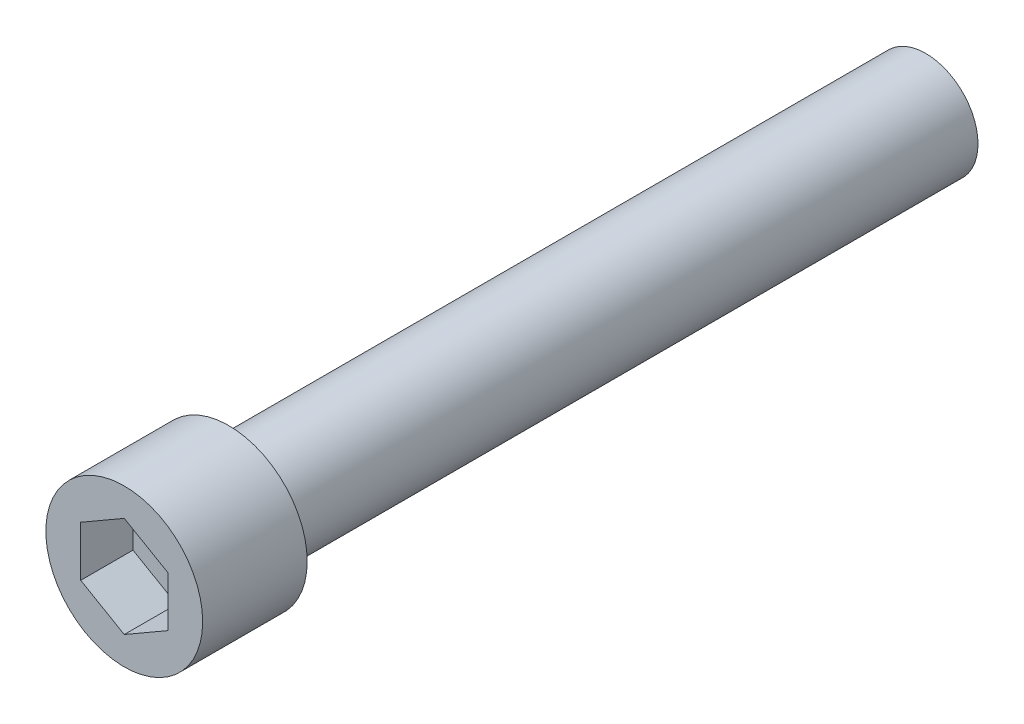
ISO-10303-21;
HEADER;
FILE_DESCRIPTION(('STEP AP214'),'2;1');
FILE_NAME('part.step','',(''),(''),'','','');
FILE_SCHEMA(('AUTOMOTIVE_DESIGN { 1 0 10303 214 1 1 1 1 }'));
ENDSEC;
DATA;
#1=APPLICATION_CONTEXT('core data for automotive mechanical design processes');
#2=APPLICATION_PROTOCOL_DEFINITION('international standard','automotive_design',2000,#1);
#3=PRODUCT_CONTEXT('',#1,'mechanical');
#4=PRODUCT('Part','Part','',(#3));
#5=PRODUCT_RELATED_PRODUCT_CATEGORY('part','',(#4));
#6=PRODUCT_DEFINITION_FORMATION('','',#4);
#7=PRODUCT_DEFINITION_CONTEXT('part definition',#1,'design');
#8=PRODUCT_DEFINITION('design','',#6,#7);
#9=PRODUCT_DEFINITION_SHAPE('','',#8);
#10=(LENGTH_UNIT() NAMED_UNIT(*) SI_UNIT(.MILLI.,.METRE.));
#11=(NAMED_UNIT(*) PLANE_ANGLE_UNIT() SI_UNIT($,.RADIAN.));
#12=(NAMED_UNIT(*) SI_UNIT($,.STERADIAN.) SOLID_ANGLE_UNIT());
#13=UNCERTAINTY_MEASURE_WITH_UNIT(LENGTH_MEASURE(1.E-05),#10,'distance_accuracy_value','');
#14=(GEOMETRIC_REPRESENTATION_CONTEXT(3) GLOBAL_UNCERTAINTY_ASSIGNED_CONTEXT((#13)) GLOBAL_UNIT_ASSIGNED_CONTEXT((#10,
#11,#12)) REPRESENTATION_CONTEXT('',''));
#15=CARTESIAN_POINT('',(0.,0.,0.));
#16=DIRECTION('',(0.,0.,1.));
#17=DIRECTION('',(1.,0.,0.));
#18=AXIS2_PLACEMENT_3D('',#15,#16,#17);
#19=CARTESIAN_POINT('',(0.,5.77350269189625,6.));
#20=DIRECTION('',(-0.5,-0.86602540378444,0.));
#21=DIRECTION('',(0.86602540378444,-0.5,0.));
#22=AXIS2_PLACEMENT_3D('',#19,#20,#21);
#23=PLANE('',#22);
#24=DIRECTION('',(0.,0.,1.));
#25=VECTOR('',#24,1.);
#26=CARTESIAN_POINT('',(5.,2.88675134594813,6.));
#27=LINE('',#26,#25);
#28=CARTESIAN_POINT('',(5.,2.88675134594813,6.));
#29=VERTEX_POINT('',#28);
#30=CARTESIAN_POINT('',(5.,2.88675134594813,12.));
#31=VERTEX_POINT('',#30);
#32=EDGE_CURVE('E63',#29,#31,#27,.T.);
#33=ORIENTED_EDGE('',*,*,#32,.T.);
#34=DIRECTION('',(0.86602540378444,-0.5,0.));
#35=VECTOR('',#34,1.);
#36=CARTESIAN_POINT('',(0.,5.77350269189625,12.));
#37=LINE('',#36,#35);
#38=CARTESIAN_POINT('',(0.,5.77350269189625,12.));
#39=VERTEX_POINT('',#38);
#40=EDGE_CURVE('E29',#39,#31,#37,.T.);
#41=ORIENTED_EDGE('',*,*,#40,.F.);
#42=DIRECTION('',(0.,0.,1.));
#43=VECTOR('',#42,1.);
#44=CARTESIAN_POINT('',(0.,5.77350269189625,6.));
#45=LINE('',#44,#43);
#46=CARTESIAN_POINT('',(0.,5.77350269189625,6.));
#47=VERTEX_POINT('',#46);
#48=EDGE_CURVE('E33',#47,#39,#45,.T.);
#49=ORIENTED_EDGE('',*,*,#48,.F.);
#50=DIRECTION('',(0.86602540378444,-0.5,0.));
#51=VECTOR('',#50,1.);
#52=CARTESIAN_POINT('',(0.,5.77350269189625,6.));
#53=LINE('',#52,#51);
#54=EDGE_CURVE('E65',#47,#29,#53,.T.);
#55=ORIENTED_EDGE('',*,*,#54,.T.);
#56=EDGE_LOOP('',(#33,#41,#49,#55));
#57=FACE_BOUND('',#56,.T.);
#58=ADVANCED_FACE('F14',(#57),#23,.T.);
#59=CARTESIAN_POINT('',(5.,-2.88675134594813,6.));
#60=DIRECTION('',(1.,0.,0.));
#61=DIRECTION('',(0.,0.,-1.));
#62=AXIS2_PLACEMENT_3D('',#59,#60,#61);
#63=PLANE('',#62);
#64=DIRECTION('',(0.,0.,1.));
#65=VECTOR('',#64,1.);
#66=CARTESIAN_POINT('',(5.,-2.88675134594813,6.));
#67=LINE('',#66,#65);
#68=CARTESIAN_POINT('',(5.,-2.88675134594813,6.));
#69=VERTEX_POINT('',#68);
#70=CARTESIAN_POINT('',(5.,-2.88675134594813,12.));
#71=VERTEX_POINT('',#70);
#72=EDGE_CURVE('E70',#69,#71,#67,.T.);
#73=ORIENTED_EDGE('',*,*,#72,.T.);
#74=DIRECTION('',(0.,1.,0.));
#75=VECTOR('',#74,1.);
#76=CARTESIAN_POINT('',(5.,-2.88675134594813,12.));
#77=LINE('',#76,#75);
#78=EDGE_CURVE('E73',#71,#31,#77,.T.);
#79=ORIENTED_EDGE('',*,*,#78,.T.);
#80=ORIENTED_EDGE('',*,*,#32,.F.);
#81=DIRECTION('',(0.,1.,0.));
#82=VECTOR('',#81,1.);
#83=CARTESIAN_POINT('',(5.,-2.88675134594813,6.));
#84=LINE('',#83,#82);
#85=EDGE_CURVE('E99',#69,#29,#84,.T.);
#86=ORIENTED_EDGE('',*,*,#85,.F.);
#87=EDGE_LOOP('',(#73,#79,#80,#86));
#88=FACE_BOUND('',#87,.T.);
#89=ADVANCED_FACE('F74',(#88),#63,.F.);
#90=CARTESIAN_POINT('',(0.,-5.77350269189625,6.));
#91=DIRECTION('',(0.5,-0.86602540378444,0.));
#92=DIRECTION('',(0.86602540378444,0.5,0.));
#93=AXIS2_PLACEMENT_3D('',#90,#91,#92);
#94=PLANE('',#93);
#95=DIRECTION('',(0.,0.,1.));
#96=VECTOR('',#95,1.);
#97=CARTESIAN_POINT('',(0.,-5.77350269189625,6.));
#98=LINE('',#97,#96);
#99=CARTESIAN_POINT('',(0.,-5.77350269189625,6.));
#100=VERTEX_POINT('',#99);
#101=CARTESIAN_POINT('',(0.,-5.77350269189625,12.));
#102=VERTEX_POINT('',#101);
#103=EDGE_CURVE('E107',#100,#102,#98,.T.);
#104=ORIENTED_EDGE('',*,*,#103,.T.);
#105=DIRECTION('',(0.86602540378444,0.5,0.));
#106=VECTOR('',#105,1.);
#107=CARTESIAN_POINT('',(0.,-5.77350269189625,12.));
#108=LINE('',#107,#106);
#109=EDGE_CURVE('E78',#102,#71,#108,.T.);
#110=ORIENTED_EDGE('',*,*,#109,.T.);
#111=ORIENTED_EDGE('',*,*,#72,.F.);
#112=DIRECTION('',(0.86602540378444,0.5,0.));
#113=VECTOR('',#112,1.);
#114=CARTESIAN_POINT('',(0.,-5.77350269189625,6.));
#115=LINE('',#114,#113);
#116=EDGE_CURVE('E96',#100,#69,#115,.T.);
#117=ORIENTED_EDGE('',*,*,#116,.F.);
#118=EDGE_LOOP('',(#104,#110,#111,#117));
#119=FACE_BOUND('',#118,.T.);
#120=ADVANCED_FACE('F140',(#119),#94,.F.);
#121=CARTESIAN_POINT('',(0.,-5.77350269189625,6.));
#122=DIRECTION('',(0.5,0.86602540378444,0.));
#123=DIRECTION('',(-0.86602540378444,0.5,0.));
#124=AXIS2_PLACEMENT_3D('',#121,#122,#123);
#125=PLANE('',#124);
#126=DIRECTION('',(0.,0.,1.));
#127=VECTOR('',#126,1.);
#128=CARTESIAN_POINT('',(-5.,-2.88675134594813,6.));
#129=LINE('',#128,#127);
#130=CARTESIAN_POINT('',(-5.,-2.88675134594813,6.));
#131=VERTEX_POINT('',#130);
#132=CARTESIAN_POINT('',(-5.,-2.88675134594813,12.));
#133=VERTEX_POINT('',#132);
#134=EDGE_CURVE('E105',#131,#133,#129,.T.);
#135=ORIENTED_EDGE('',*,*,#134,.T.);
#136=DIRECTION('',(-0.86602540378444,0.5,0.));
#137=VECTOR('',#136,1.);
#138=CARTESIAN_POINT('',(0.,-5.77350269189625,12.));
#139=LINE('',#138,#137);
#140=EDGE_CURVE('E248',#102,#133,#139,.T.);
#141=ORIENTED_EDGE('',*,*,#140,.F.);
#142=ORIENTED_EDGE('',*,*,#103,.F.);
#143=DIRECTION('',(-0.86602540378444,0.5,0.));
#144=VECTOR('',#143,1.);
#145=CARTESIAN_POINT('',(0.,-5.77350269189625,6.));
#146=LINE('',#145,#144);
#147=EDGE_CURVE('E93',#100,#131,#146,.T.);
#148=ORIENTED_EDGE('',*,*,#147,.T.);
#149=EDGE_LOOP('',(#135,#141,#142,#148));
#150=FACE_BOUND('',#149,.T.);
#151=ADVANCED_FACE('F152',(#150),#125,.T.);
#152=CARTESIAN_POINT('',(-5.,2.88675134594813,6.));
#153=DIRECTION('',(-1.,0.,0.));
#154=DIRECTION('',(0.,-1.,0.));
#155=AXIS2_PLACEMENT_3D('',#152,#153,#154);
#156=PLANE('',#155);
#157=DIRECTION('',(0.,0.,1.));
#158=VECTOR('',#157,1.);
#159=CARTESIAN_POINT('',(-5.,2.88675134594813,6.));
#160=LINE('',#159,#158);
#161=CARTESIAN_POINT('',(-5.,2.88675134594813,6.));
#162=VERTEX_POINT('',#161);
#163=CARTESIAN_POINT('',(-5.,2.88675134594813,12.));
#164=VERTEX_POINT('',#163);
#165=EDGE_CURVE('E103',#162,#164,#160,.T.);
#166=ORIENTED_EDGE('',*,*,#165,.T.);
#167=DIRECTION('',(0.,-1.,0.));
#168=VECTOR('',#167,1.);
#169=CARTESIAN_POINT('',(-5.,2.88675134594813,12.));
#170=LINE('',#169,#168);
#171=EDGE_CURVE('E249',#164,#133,#170,.T.);
#172=ORIENTED_EDGE('',*,*,#171,.T.);
#173=ORIENTED_EDGE('',*,*,#134,.F.);
#174=DIRECTION('',(0.,-1.,0.));
#175=VECTOR('',#174,1.);
#176=CARTESIAN_POINT('',(-5.,2.88675134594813,6.));
#177=LINE('',#176,#175);
#178=EDGE_CURVE('E90',#162,#131,#177,.T.);
#179=ORIENTED_EDGE('',*,*,#178,.F.);
#180=EDGE_LOOP('',(#166,#172,#173,#179));
#181=FACE_BOUND('',#180,.T.);
#182=ADVANCED_FACE('F148',(#181),#156,.F.);
#183=CARTESIAN_POINT('',(0.,5.77350269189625,6.));
#184=DIRECTION('',(-0.5,0.86602540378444,0.));
#185=DIRECTION('',(-0.86602540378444,-0.5,0.));
#186=AXIS2_PLACEMENT_3D('',#183,#184,#185);
#187=PLANE('',#186);
#188=DIRECTION('',(-0.86602540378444,-0.5,0.));
#189=VECTOR('',#188,1.);
#190=CARTESIAN_POINT('',(0.,5.77350269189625,6.));
#191=LINE('',#190,#189);
#192=EDGE_CURVE('E87',#47,#162,#191,.T.);
#193=ORIENTED_EDGE('',*,*,#192,.F.);
#194=ORIENTED_EDGE('',*,*,#48,.T.);
#195=DIRECTION('',(-0.86602540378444,-0.5,0.));
#196=VECTOR('',#195,1.);
#197=CARTESIAN_POINT('',(0.,5.77350269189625,12.));
#198=LINE('',#197,#196);
#199=EDGE_CURVE('E83',#39,#164,#198,.T.);
#200=ORIENTED_EDGE('',*,*,#199,.T.);
#201=ORIENTED_EDGE('',*,*,#165,.F.);
#202=EDGE_LOOP('',(#193,#194,#200,#201));
#203=FACE_BOUND('',#202,.T.);
#204=ADVANCED_FACE('F145',(#203),#187,.F.);
#205=CARTESIAN_POINT('',(-5.,8.66025403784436,6.));
#206=DIRECTION('',(0.,0.,-1.));
#207=DIRECTION('',(-1.,0.,0.));
#208=AXIS2_PLACEMENT_3D('',#205,#206,#207);
#209=PLANE('',#208);
#210=ORIENTED_EDGE('',*,*,#54,.F.);
#211=ORIENTED_EDGE('',*,*,#192,.T.);
#212=ORIENTED_EDGE('',*,*,#178,.T.);
#213=ORIENTED_EDGE('',*,*,#147,.F.);
#214=ORIENTED_EDGE('',*,*,#116,.T.);
#215=ORIENTED_EDGE('',*,*,#85,.T.);
#216=EDGE_LOOP('',(#210,#211,#212,#213,#214,#215));
#217=FACE_BOUND('',#216,.T.);
#218=ADVANCED_FACE('F144',(#217),#209,.F.);
#219=CARTESIAN_POINT('',(0.,0.,12.));
#220=DIRECTION('',(0.,0.,1.));
#221=DIRECTION('',(1.,0.,0.));
#222=AXIS2_PLACEMENT_3D('',#219,#220,#221);
#223=PLANE('',#222);
#224=CARTESIAN_POINT('',(0.,0.,12.));
#225=DIRECTION('',(0.,0.,1.));
#226=DIRECTION('',(1.,0.,0.));
#227=AXIS2_PLACEMENT_3D('',#224,#225,#226);
#228=CIRCLE('',#227,9.);
#229=CARTESIAN_POINT('',(9.,0.,12.));
#230=VERTEX_POINT('',#229);
#231=EDGE_CURVE('E9',#230,#230,#228,.T.);
#232=ORIENTED_EDGE('',*,*,#231,.T.);
#233=EDGE_LOOP('',(#232));
#234=FACE_BOUND('',#233,.T.);
#235=ORIENTED_EDGE('',*,*,#199,.F.);
#236=ORIENTED_EDGE('',*,*,#40,.T.);
#237=ORIENTED_EDGE('',*,*,#78,.F.);
#238=ORIENTED_EDGE('',*,*,#109,.F.);
#239=ORIENTED_EDGE('',*,*,#140,.T.);
#240=ORIENTED_EDGE('',*,*,#171,.F.);
#241=EDGE_LOOP('',(#235,#236,#237,#238,#239,#240));
#242=FACE_BOUND('',#241,.T.);
#243=ADVANCED_FACE('F16',(#234,#242),#223,.T.);
#244=CARTESIAN_POINT('',(0.,0.,-60.));
#245=DIRECTION('',(0.,0.,1.));
#246=DIRECTION('',(1.,0.,0.));
#247=AXIS2_PLACEMENT_3D('',#244,#245,#246);
#248=CYLINDRICAL_SURFACE('',#247,9.);
#249=CARTESIAN_POINT('',(0.,0.,0.));
#250=DIRECTION('',(0.,0.,1.));
#251=DIRECTION('',(1.,0.,0.));
#252=AXIS2_PLACEMENT_3D('',#249,#250,#251);
#253=CIRCLE('',#252,9.);
#254=CARTESIAN_POINT('',(9.,0.,0.));
#255=VERTEX_POINT('',#254);
#256=EDGE_CURVE('E22',#255,#255,#253,.T.);
#257=ORIENTED_EDGE('',*,*,#256,.T.);
#258=EDGE_LOOP('',(#257));
#259=FACE_BOUND('',#258,.T.);
#260=ORIENTED_EDGE('',*,*,#231,.F.);
#261=EDGE_LOOP('',(#260));
#262=FACE_BOUND('',#261,.T.);
#263=ADVANCED_FACE('F117',(#259,#262),#248,.T.);
#264=CARTESIAN_POINT('',(9.,0.,0.));
#265=DIRECTION('',(0.,0.,-1.));
#266=DIRECTION('',(-1.,0.,0.));
#267=AXIS2_PLACEMENT_3D('',#264,#265,#266);
#268=PLANE('',#267);
#269=CARTESIAN_POINT('',(0.,0.,0.));
#270=DIRECTION('',(0.,0.,1.));
#271=DIRECTION('',(1.,0.,0.));
#272=AXIS2_PLACEMENT_3D('',#269,#270,#271);
#273=CIRCLE('',#272,6.);
#274=CARTESIAN_POINT('',(6.,0.,0.));
#275=VERTEX_POINT('',#274);
#276=EDGE_CURVE('E112',#275,#275,#273,.T.);
#277=ORIENTED_EDGE('',*,*,#276,.T.);
#278=EDGE_LOOP('',(#277));
#279=FACE_BOUND('',#278,.T.);
#280=ORIENTED_EDGE('',*,*,#256,.F.);
#281=EDGE_LOOP('',(#280));
#282=FACE_BOUND('',#281,.T.);
#283=ADVANCED_FACE('F120',(#279,#282),#268,.T.);
#284=CARTESIAN_POINT('',(0.,0.,-60.));
#285=DIRECTION('',(0.,0.,1.));
#286=DIRECTION('',(1.,0.,0.));
#287=AXIS2_PLACEMENT_3D('',#284,#285,#286);
#288=CYLINDRICAL_SURFACE('',#287,6.);
#289=CARTESIAN_POINT('',(0.,0.,-80.));
#290=DIRECTION('',(0.,0.,1.));
#291=DIRECTION('',(1.,0.,0.));
#292=AXIS2_PLACEMENT_3D('',#289,#290,#291);
#293=CIRCLE('',#292,6.);
#294=CARTESIAN_POINT('',(6.,0.,-80.));
#295=VERTEX_POINT('',#294);
#296=EDGE_CURVE('E69',#295,#295,#293,.T.);
#297=ORIENTED_EDGE('',*,*,#296,.T.);
#298=EDGE_LOOP('',(#297));
#299=FACE_BOUND('',#298,.T.);
#300=ORIENTED_EDGE('',*,*,#276,.F.);
#301=EDGE_LOOP('',(#300));
#302=FACE_BOUND('',#301,.T.);
#303=ADVANCED_FACE('F122',(#299,#302),#288,.T.);
#304=CARTESIAN_POINT('',(6.,0.,-80.));
#305=DIRECTION('',(0.,0.,-1.));
#306=DIRECTION('',(-1.,0.,0.));
#307=AXIS2_PLACEMENT_3D('',#304,#305,#306);
#308=PLANE('',#307);
#309=ORIENTED_EDGE('',*,*,#296,.F.);
#310=EDGE_LOOP('',(#309));
#311=FACE_BOUND('',#310,.T.);
#312=ADVANCED_FACE('F131',(#311),#308,.T.);
#313=CLOSED_SHELL('',(#58,#89,#120,#151,#182,#204,#218,#243,#263,#283,#303,#312));
#314=MANIFOLD_SOLID_BREP('B1',#313);
#315=ADVANCED_BREP_SHAPE_REPRESENTATION('',(#18,#314),#14);
#316=SHAPE_DEFINITION_REPRESENTATION(#9,#315);
ENDSEC;
END-ISO-10303-21;
